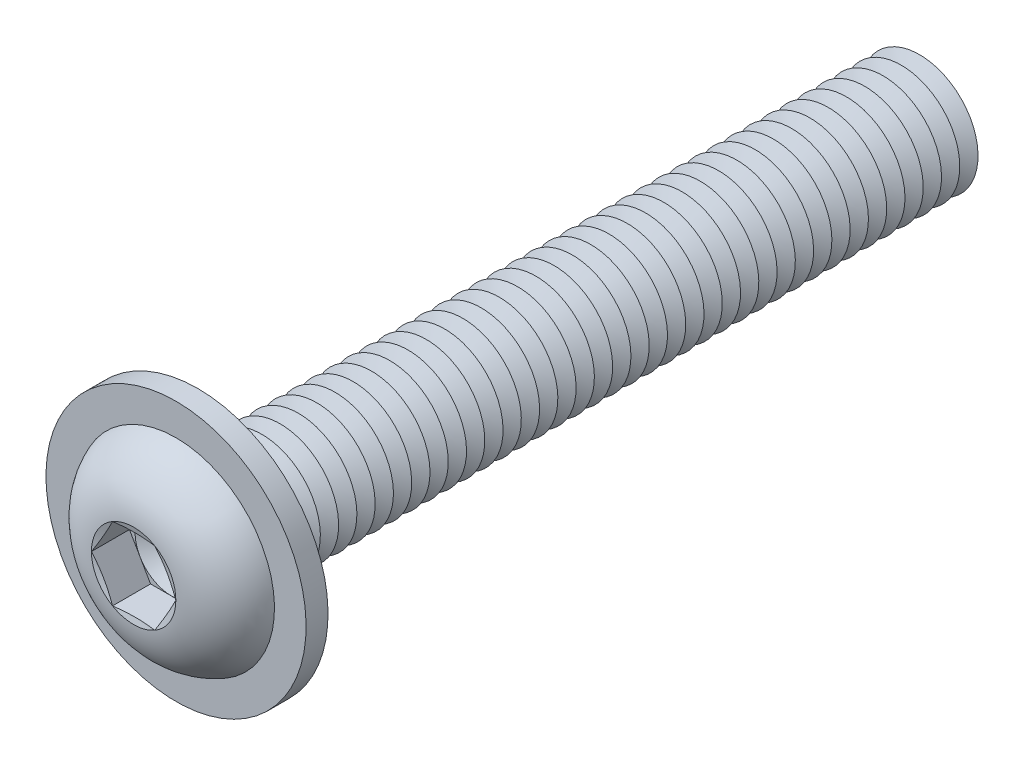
from build123d import *

# Parameters (mm, degrees)
FILLET1_R           = 0.625
LPATTERN1_COUNT     = 40
LPATTERN1_PITCH     = 1.25
CUT_EXTRUDE1_DEPTH  = 2.6
SKETCH5_R           = 8.9
SKETCH5_R_2         = 4.625
BOSS_EXTRUDE1_DEPTH = 1.5


with BuildPart() as part:
    # Sketch1 → Revolve1 (revolve)
    with BuildSketch(Plane(origin=(0, 0, 0), x_dir=(0, 0, -1), z_dir=(1, 0, 0))):
        with BuildLine():
            Line((0, 4), (0, 7))
            ThreePointArc((0, 7), (-3.011595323, 5.81154966), (-4.4, 2.88675))
            Line((-4.4, 2.88675), (-4.013248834, 1.443375))
            Line((-4.013248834, 1.443375), (-4.4, 1.443375))
            Line((-4.4, 1.443375), (-4.4, 0))
            Line((-4.4, 0), (50, 0))
            Line((50, 0), (50, 4))
            Line((50, 4), (0, 4))
        make_face()
    revolve(axis=Axis((0, 0, -50), (0, 0, 1)))

    # Fillet1
    fillet1_edges = [part.edges().sort_by_distance(p)[0] for p in [
        (0, -4, 0),
    ]]
    fillet(fillet1_edges, radius=FILLET1_R)

    # Sketch2 → Cut-Revolve1 (revolve, cut)
    with BuildSketch(Plane(origin=(0, 0, 0), x_dir=(0, 0, -1), z_dir=(1, 0, 0))):
        Polygon((49.375, 4), (50.625, 4), (50, 2.917468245), align=None)
    cut_revolve1 = revolve(axis=Axis((0, 0, -50), (0, 0, -1)), mode=Mode.SUBTRACT)

    # LPattern1: Cut-Revolve1 ×40
    with Locations(*[(0, 0, i * LPATTERN1_PITCH) for i in range(1, LPATTERN1_COUNT)]):
        add(cut_revolve1, mode=Mode.SUBTRACT)

    # Sketch3 → Cut-Extrude1 (cut)
    with BuildSketch(Plane.XY.offset(4.4)):
        Polygon((1.443375, 2.499998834), (-1.443375, 2.499998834), (-2.88675, 0), (-1.443375, -2.499998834), (1.443375, -2.499998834), (2.88675, 0), align=None)
    extrude(amount=-CUT_EXTRUDE1_DEPTH, mode=Mode.SUBTRACT)

    # Cut-Extrude2 cone 1 section (on through the dimple's axis) → Cut-Extrude2 (revolve, cut)
    with BuildSketch(Plane(origin=(0, 0, 1.8), x_dir=(0, -1, 0), z_dir=(1, 0, 0))):
        Polygon((0, 0), (2.499998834, 0), (0, 1.443375), align=None)
    revolve(axis=Axis((0, 0, 1.8), (0, 0, -1)), mode=Mode.SUBTRACT)

    # Sketch5 → Boss-Extrude1 (add)
    with BuildSketch(Plane(origin=(0, 0, 0), x_dir=(-1, 0, 0), z_dir=(0, 0, -1))):
        with Locations(Location((0, 0, 0), (0, 0, 90))):
            Circle(SKETCH5_R)
        Circle(SKETCH5_R_2, mode=Mode.SUBTRACT)
    extrude(amount=-BOSS_EXTRUDE1_DEPTH)


solid = part.part
